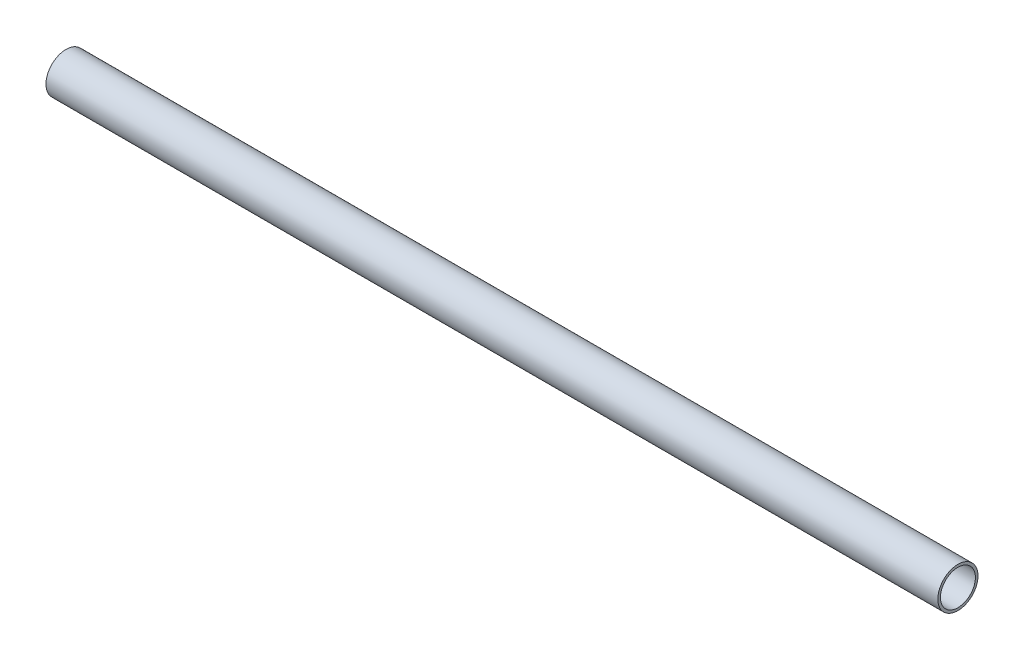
from build123d import *

# Parameters (mm, degrees)
SKETCH1_W = 323.85
SKETCH1_H = 0.9398


with BuildPart() as part:
    # Sketch1 → Revolve1 (revolve)
    with BuildSketch(Plane.XY, mode=Mode.PRIVATE) as revolve1_sk:
        with Locations((0, 6.8199)):
            Rectangle(SKETCH1_W, SKETCH1_H)
    revolve(revolve1_sk.sketch.rotate(Axis((88.857533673, 0, 0), (-1, 0, 0)), 90), axis=Axis((88.857533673, 0, 0), (-1, 0, 0)))


solid = part.part
